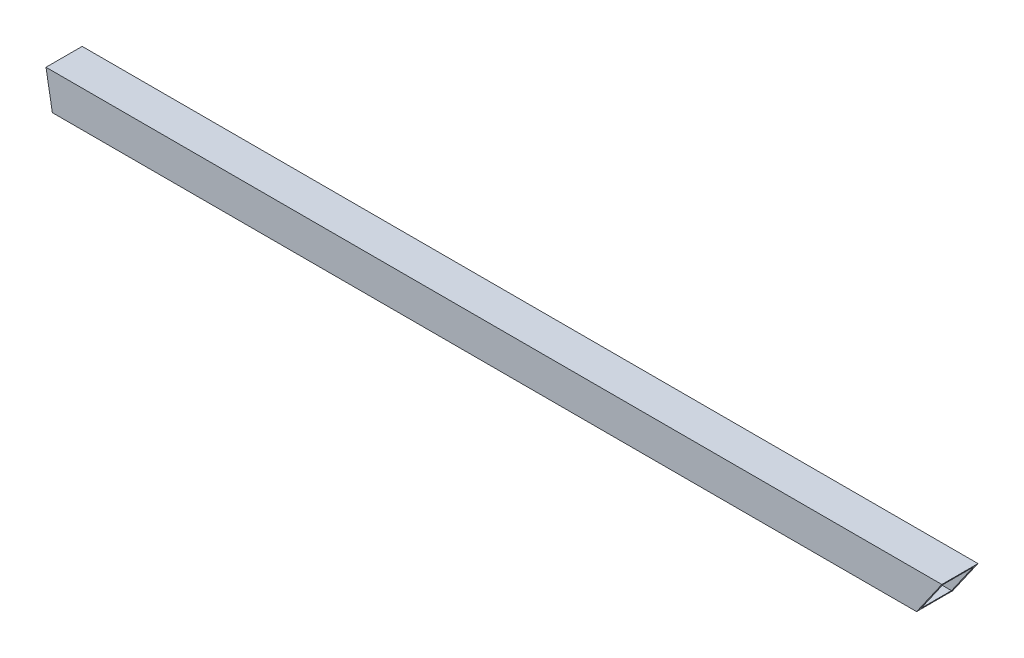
ISO-10303-21;
HEADER;
FILE_DESCRIPTION(('STEP AP214'),'2;1');
FILE_NAME('part.step','',(''),(''),'','','');
FILE_SCHEMA(('AUTOMOTIVE_DESIGN { 1 0 10303 214 1 1 1 1 }'));
ENDSEC;
DATA;
#1=APPLICATION_CONTEXT('core data for automotive mechanical design processes');
#2=APPLICATION_PROTOCOL_DEFINITION('international standard','automotive_design',2000,#1);
#3=PRODUCT_CONTEXT('',#1,'mechanical');
#4=PRODUCT('Part','Part','',(#3));
#5=PRODUCT_RELATED_PRODUCT_CATEGORY('part','',(#4));
#6=PRODUCT_DEFINITION_FORMATION('','',#4);
#7=PRODUCT_DEFINITION_CONTEXT('part definition',#1,'design');
#8=PRODUCT_DEFINITION('design','',#6,#7);
#9=PRODUCT_DEFINITION_SHAPE('','',#8);
#10=(LENGTH_UNIT() NAMED_UNIT(*) SI_UNIT(.MILLI.,.METRE.));
#11=(NAMED_UNIT(*) PLANE_ANGLE_UNIT() SI_UNIT($,.RADIAN.));
#12=(NAMED_UNIT(*) SI_UNIT($,.STERADIAN.) SOLID_ANGLE_UNIT());
#13=UNCERTAINTY_MEASURE_WITH_UNIT(LENGTH_MEASURE(1.E-05),#10,'distance_accuracy_value','');
#14=(GEOMETRIC_REPRESENTATION_CONTEXT(3) GLOBAL_UNCERTAINTY_ASSIGNED_CONTEXT((#13)) GLOBAL_UNIT_ASSIGNED_CONTEXT((#10,
#11,#12)) REPRESENTATION_CONTEXT('',''));
#15=CARTESIAN_POINT('',(0.,0.,0.));
#16=DIRECTION('',(0.,0.,1.));
#17=DIRECTION('',(1.,0.,0.));
#18=AXIS2_PLACEMENT_3D('',#15,#16,#17);
#19=CARTESIAN_POINT('',(25.1741938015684,-25.,25.));
#20=DIRECTION('',(0.984922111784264,0.172998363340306,0.));
#21=DIRECTION('',(-0.172998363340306,0.984922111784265,0.));
#22=AXIS2_PLACEMENT_3D('',#19,#20,#21);
#23=PLANE('',#22);
#24=DIRECTION('',(0.,0.,1.));
#25=VECTOR('',#24,1.);
#26=CARTESIAN_POINT('',(21.0710870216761,-1.64000678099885,25.));
#27=LINE('',#26,#25);
#28=CARTESIAN_POINT('',(21.0710870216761,-1.64000678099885,2.));
#29=VERTEX_POINT('',#28);
#30=CARTESIAN_POINT('',(21.0710870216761,-1.64000678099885,23.));
#31=VERTEX_POINT('',#30);
#32=EDGE_CURVE('E130',#29,#31,#27,.T.);
#33=ORIENTED_EDGE('',*,*,#32,.T.);
#34=DIRECTION('',(0.172998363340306,-0.984922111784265,0.));
#35=VECTOR('',#34,1.);
#36=CARTESIAN_POINT('',(25.1741938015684,-25.,23.));
#37=LINE('',#36,#35);
#38=CARTESIAN_POINT('',(24.8861319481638,-23.3599932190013,23.));
#39=VERTEX_POINT('',#38);
#40=EDGE_CURVE('E133',#31,#39,#37,.T.);
#41=ORIENTED_EDGE('',*,*,#40,.T.);
#42=DIRECTION('',(0.,0.,-1.));
#43=VECTOR('',#42,1.);
#44=CARTESIAN_POINT('',(24.8861319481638,-23.3599932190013,25.));
#45=LINE('',#44,#43);
#46=CARTESIAN_POINT('',(24.8861319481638,-23.3599932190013,2.));
#47=VERTEX_POINT('',#46);
#48=EDGE_CURVE('E125',#39,#47,#45,.T.);
#49=ORIENTED_EDGE('',*,*,#48,.T.);
#50=DIRECTION('',(-0.172998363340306,0.984922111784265,0.));
#51=VECTOR('',#50,1.);
#52=CARTESIAN_POINT('',(25.1741938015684,-25.,2.));
#53=LINE('',#52,#51);
#54=EDGE_CURVE('E105',#47,#29,#53,.T.);
#55=ORIENTED_EDGE('',*,*,#54,.T.);
#56=EDGE_LOOP('',(#33,#41,#49,#55));
#57=FACE_BOUND('',#56,.T.);
#58=DIRECTION('',(0.172998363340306,-0.984922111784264,0.));
#59=VECTOR('',#58,1.);
#60=CARTESIAN_POINT('',(25.1741938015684,-25.,0.));
#61=LINE('',#60,#59);
#62=CARTESIAN_POINT('',(20.7830251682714,0.,0.));
#63=VERTEX_POINT('',#62);
#64=CARTESIAN_POINT('',(25.1741938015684,-25.,0.));
#65=VERTEX_POINT('',#64);
#66=EDGE_CURVE('E136',#63,#65,#61,.T.);
#67=ORIENTED_EDGE('',*,*,#66,.T.);
#68=DIRECTION('',(0.,0.,-1.));
#69=VECTOR('',#68,1.);
#70=CARTESIAN_POINT('',(25.1741938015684,-25.,25.));
#71=LINE('',#70,#69);
#72=CARTESIAN_POINT('',(25.1741938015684,-25.,25.));
#73=VERTEX_POINT('',#72);
#74=EDGE_CURVE('E11',#73,#65,#71,.T.);
#75=ORIENTED_EDGE('',*,*,#74,.F.);
#76=DIRECTION('',(0.172998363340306,-0.984922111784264,0.));
#77=VECTOR('',#76,1.);
#78=CARTESIAN_POINT('',(25.1741938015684,-25.,25.));
#79=LINE('',#78,#77);
#80=CARTESIAN_POINT('',(20.7830251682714,0.,25.));
#81=VERTEX_POINT('',#80);
#82=EDGE_CURVE('E137',#81,#73,#79,.T.);
#83=ORIENTED_EDGE('',*,*,#82,.F.);
#84=DIRECTION('',(0.,0.,-1.));
#85=VECTOR('',#84,1.);
#86=CARTESIAN_POINT('',(20.7830251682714,0.,25.));
#87=LINE('',#86,#85);
#88=EDGE_CURVE('E147',#81,#63,#87,.T.);
#89=ORIENTED_EDGE('',*,*,#88,.T.);
#90=EDGE_LOOP('',(#67,#75,#83,#89));
#91=FACE_BOUND('',#90,.T.);
#92=ADVANCED_FACE('F35',(#57,#91),#23,.F.);
#93=CARTESIAN_POINT('',(622.550112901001,-25.,25.));
#94=DIRECTION('',(0.,1.,0.));
#95=DIRECTION('',(0.,0.,1.));
#96=AXIS2_PLACEMENT_3D('',#93,#94,#95);
#97=PLANE('',#96);
#98=DIRECTION('',(1.,0.,0.));
#99=VECTOR('',#98,1.);
#100=CARTESIAN_POINT('',(622.550112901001,-25.,0.));
#101=LINE('',#100,#99);
#102=CARTESIAN_POINT('',(622.550112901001,-25.,0.));
#103=VERTEX_POINT('',#102);
#104=EDGE_CURVE('E150',#65,#103,#101,.T.);
#105=ORIENTED_EDGE('',*,*,#104,.T.);
#106=DIRECTION('',(0.,0.,-1.));
#107=VECTOR('',#106,1.);
#108=CARTESIAN_POINT('',(622.550112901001,-25.,25.));
#109=LINE('',#108,#107);
#110=CARTESIAN_POINT('',(622.550112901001,-25.,25.));
#111=VERTEX_POINT('',#110);
#112=EDGE_CURVE('E42',#111,#103,#109,.T.);
#113=ORIENTED_EDGE('',*,*,#112,.F.);
#114=DIRECTION('',(1.,0.,0.));
#115=VECTOR('',#114,1.);
#116=CARTESIAN_POINT('',(622.550112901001,-25.,25.));
#117=LINE('',#116,#115);
#118=EDGE_CURVE('E140',#73,#111,#117,.T.);
#119=ORIENTED_EDGE('',*,*,#118,.F.);
#120=ORIENTED_EDGE('',*,*,#74,.T.);
#121=EDGE_LOOP('',(#105,#113,#119,#120));
#122=FACE_BOUND('',#121,.T.);
#123=ADVANCED_FACE('F178',(#122),#97,.F.);
#124=CARTESIAN_POINT('',(640.,0.,25.));
#125=DIRECTION('',(-0.820003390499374,0.572358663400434,0.));
#126=DIRECTION('',(-0.572358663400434,-0.820003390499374,0.));
#127=AXIS2_PLACEMENT_3D('',#124,#125,#126);
#128=PLANE('',#127);
#129=DIRECTION('',(0.,0.,-1.));
#130=VECTOR('',#129,1.);
#131=CARTESIAN_POINT('',(623.694830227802,-23.3599932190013,23.));
#132=LINE('',#131,#130);
#133=CARTESIAN_POINT('',(623.694830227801,-23.3599932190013,23.));
#134=VERTEX_POINT('',#133);
#135=CARTESIAN_POINT('',(623.694830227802,-23.3599932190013,2.));
#136=VERTEX_POINT('',#135);
#137=EDGE_CURVE('E111',#134,#136,#132,.T.);
#138=ORIENTED_EDGE('',*,*,#137,.F.);
#139=DIRECTION('',(-0.572358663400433,-0.820003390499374,0.));
#140=VECTOR('',#139,1.);
#141=CARTESIAN_POINT('',(623.694830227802,-23.3599932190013,23.));
#142=LINE('',#141,#140);
#143=CARTESIAN_POINT('',(638.855282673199,-1.64000678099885,23.));
#144=VERTEX_POINT('',#143);
#145=EDGE_CURVE('E57',#144,#134,#142,.T.);
#146=ORIENTED_EDGE('',*,*,#145,.F.);
#147=DIRECTION('',(0.,0.,1.));
#148=VECTOR('',#147,1.);
#149=CARTESIAN_POINT('',(638.855282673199,-1.64000678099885,23.));
#150=LINE('',#149,#148);
#151=CARTESIAN_POINT('',(638.855282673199,-1.64000678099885,2.));
#152=VERTEX_POINT('',#151);
#153=EDGE_CURVE('E118',#152,#144,#150,.T.);
#154=ORIENTED_EDGE('',*,*,#153,.F.);
#155=DIRECTION('',(0.572358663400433,0.820003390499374,0.));
#156=VECTOR('',#155,1.);
#157=CARTESIAN_POINT('',(623.694830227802,-23.3599932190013,2.));
#158=LINE('',#157,#156);
#159=EDGE_CURVE('E102',#136,#152,#158,.T.);
#160=ORIENTED_EDGE('',*,*,#159,.F.);
#161=EDGE_LOOP('',(#138,#146,#154,#160));
#162=FACE_BOUND('',#161,.T.);
#163=DIRECTION('',(0.572358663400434,0.820003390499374,0.));
#164=VECTOR('',#163,1.);
#165=CARTESIAN_POINT('',(640.,0.,0.));
#166=LINE('',#165,#164);
#167=CARTESIAN_POINT('',(640.,0.,0.));
#168=VERTEX_POINT('',#167);
#169=EDGE_CURVE('E152',#103,#168,#166,.T.);
#170=ORIENTED_EDGE('',*,*,#169,.T.);
#171=DIRECTION('',(0.,0.,-1.));
#172=VECTOR('',#171,1.);
#173=CARTESIAN_POINT('',(640.,0.,25.));
#174=LINE('',#173,#172);
#175=CARTESIAN_POINT('',(640.,0.,25.));
#176=VERTEX_POINT('',#175);
#177=EDGE_CURVE('E157',#176,#168,#174,.T.);
#178=ORIENTED_EDGE('',*,*,#177,.F.);
#179=DIRECTION('',(0.572358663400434,0.820003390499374,0.));
#180=VECTOR('',#179,1.);
#181=CARTESIAN_POINT('',(640.,0.,25.));
#182=LINE('',#181,#180);
#183=EDGE_CURVE('E143',#111,#176,#182,.T.);
#184=ORIENTED_EDGE('',*,*,#183,.F.);
#185=ORIENTED_EDGE('',*,*,#112,.T.);
#186=EDGE_LOOP('',(#170,#178,#184,#185));
#187=FACE_BOUND('',#186,.T.);
#188=ADVANCED_FACE('F115',(#162,#187),#128,.F.);
#189=CARTESIAN_POINT('',(20.7830251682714,0.,25.));
#190=DIRECTION('',(0.,-1.,0.));
#191=DIRECTION('',(0.,0.,-1.));
#192=AXIS2_PLACEMENT_3D('',#189,#190,#191);
#193=PLANE('',#192);
#194=DIRECTION('',(-1.,0.,0.));
#195=VECTOR('',#194,1.);
#196=CARTESIAN_POINT('',(20.7830251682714,0.,0.));
#197=LINE('',#196,#195);
#198=EDGE_CURVE('E141',#168,#63,#197,.T.);
#199=ORIENTED_EDGE('',*,*,#198,.T.);
#200=ORIENTED_EDGE('',*,*,#88,.F.);
#201=DIRECTION('',(-1.,0.,0.));
#202=VECTOR('',#201,1.);
#203=CARTESIAN_POINT('',(20.7830251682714,0.,25.));
#204=LINE('',#203,#202);
#205=EDGE_CURVE('E145',#176,#81,#204,.T.);
#206=ORIENTED_EDGE('',*,*,#205,.F.);
#207=ORIENTED_EDGE('',*,*,#177,.T.);
#208=EDGE_LOOP('',(#199,#200,#206,#207));
#209=FACE_BOUND('',#208,.T.);
#210=ADVANCED_FACE('F171',(#209),#193,.F.);
#211=CARTESIAN_POINT('',(0.,0.,25.));
#212=DIRECTION('',(0.,0.,-1.));
#213=DIRECTION('',(-1.,0.,0.));
#214=AXIS2_PLACEMENT_3D('',#211,#212,#213);
#215=PLANE('',#214);
#216=ORIENTED_EDGE('',*,*,#82,.T.);
#217=ORIENTED_EDGE('',*,*,#118,.T.);
#218=ORIENTED_EDGE('',*,*,#183,.T.);
#219=ORIENTED_EDGE('',*,*,#205,.T.);
#220=EDGE_LOOP('',(#216,#217,#218,#219));
#221=FACE_BOUND('',#220,.T.);
#222=ADVANCED_FACE('F177',(#221),#215,.F.);
#223=CARTESIAN_POINT('',(0.,0.,0.));
#224=DIRECTION('',(0.,0.,-1.));
#225=DIRECTION('',(-1.,0.,0.));
#226=AXIS2_PLACEMENT_3D('',#223,#224,#225);
#227=PLANE('',#226);
#228=ORIENTED_EDGE('',*,*,#66,.F.);
#229=ORIENTED_EDGE('',*,*,#198,.F.);
#230=ORIENTED_EDGE('',*,*,#169,.F.);
#231=ORIENTED_EDGE('',*,*,#104,.F.);
#232=EDGE_LOOP('',(#228,#229,#230,#231));
#233=FACE_BOUND('',#232,.T.);
#234=ADVANCED_FACE('F168',(#233),#227,.T.);
#235=CARTESIAN_POINT('',(5.62257272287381,-23.3599932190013,23.));
#236=DIRECTION('',(0.,0.,1.));
#237=DIRECTION('',(1.,0.,0.));
#238=AXIS2_PLACEMENT_3D('',#235,#236,#237);
#239=PLANE('',#238);
#240=DIRECTION('',(1.,0.,0.));
#241=VECTOR('',#240,1.);
#242=CARTESIAN_POINT('',(20.7830251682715,-1.64000678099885,23.));
#243=LINE('',#242,#241);
#244=EDGE_CURVE('E123',#31,#144,#243,.T.);
#245=ORIENTED_EDGE('',*,*,#244,.T.);
#246=ORIENTED_EDGE('',*,*,#145,.T.);
#247=DIRECTION('',(1.,0.,0.));
#248=VECTOR('',#247,1.);
#249=CARTESIAN_POINT('',(5.62257272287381,-23.3599932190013,23.));
#250=LINE('',#249,#248);
#251=EDGE_CURVE('E108',#39,#134,#250,.T.);
#252=ORIENTED_EDGE('',*,*,#251,.F.);
#253=ORIENTED_EDGE('',*,*,#40,.F.);
#254=EDGE_LOOP('',(#245,#246,#252,#253));
#255=FACE_BOUND('',#254,.T.);
#256=ADVANCED_FACE('F191',(#255),#239,.F.);
#257=CARTESIAN_POINT('',(20.7830251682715,-1.64000678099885,23.));
#258=DIRECTION('',(0.,1.,0.));
#259=DIRECTION('',(0.,0.,1.));
#260=AXIS2_PLACEMENT_3D('',#257,#258,#259);
#261=PLANE('',#260);
#262=DIRECTION('',(1.,0.,0.));
#263=VECTOR('',#262,1.);
#264=CARTESIAN_POINT('',(20.7830251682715,-1.64000678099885,2.));
#265=LINE('',#264,#263);
#266=EDGE_CURVE('E107',#29,#152,#265,.T.);
#267=ORIENTED_EDGE('',*,*,#266,.T.);
#268=ORIENTED_EDGE('',*,*,#153,.T.);
#269=ORIENTED_EDGE('',*,*,#244,.F.);
#270=ORIENTED_EDGE('',*,*,#32,.F.);
#271=EDGE_LOOP('',(#267,#268,#269,#270));
#272=FACE_BOUND('',#271,.T.);
#273=ADVANCED_FACE('F196',(#272),#261,.F.);
#274=CARTESIAN_POINT('',(5.62257272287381,-23.3599932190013,2.));
#275=DIRECTION('',(0.,0.,-1.));
#276=DIRECTION('',(-1.,0.,0.));
#277=AXIS2_PLACEMENT_3D('',#274,#275,#276);
#278=PLANE('',#277);
#279=DIRECTION('',(1.,0.,0.));
#280=VECTOR('',#279,1.);
#281=CARTESIAN_POINT('',(5.62257272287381,-23.3599932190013,2.));
#282=LINE('',#281,#280);
#283=EDGE_CURVE('E49',#47,#136,#282,.T.);
#284=ORIENTED_EDGE('',*,*,#283,.T.);
#285=ORIENTED_EDGE('',*,*,#159,.T.);
#286=ORIENTED_EDGE('',*,*,#266,.F.);
#287=ORIENTED_EDGE('',*,*,#54,.F.);
#288=EDGE_LOOP('',(#284,#285,#286,#287));
#289=FACE_BOUND('',#288,.T.);
#290=ADVANCED_FACE('F99',(#289),#278,.F.);
#291=CARTESIAN_POINT('',(5.62257272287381,-23.3599932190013,23.));
#292=DIRECTION('',(0.,-1.,0.));
#293=DIRECTION('',(0.,0.,-1.));
#294=AXIS2_PLACEMENT_3D('',#291,#292,#293);
#295=PLANE('',#294);
#296=ORIENTED_EDGE('',*,*,#251,.T.);
#297=ORIENTED_EDGE('',*,*,#137,.T.);
#298=ORIENTED_EDGE('',*,*,#283,.F.);
#299=ORIENTED_EDGE('',*,*,#48,.F.);
#300=EDGE_LOOP('',(#296,#297,#298,#299));
#301=FACE_BOUND('',#300,.T.);
#302=ADVANCED_FACE('F112',(#301),#295,.F.);
#303=CLOSED_SHELL('',(#92,#123,#188,#210,#222,#234,#256,#273,#290,#302));
#304=MANIFOLD_SOLID_BREP('B2',#303);
#305=ADVANCED_BREP_SHAPE_REPRESENTATION('',(#18,#304),#14);
#306=SHAPE_DEFINITION_REPRESENTATION(#9,#305);
ENDSEC;
END-ISO-10303-21;
